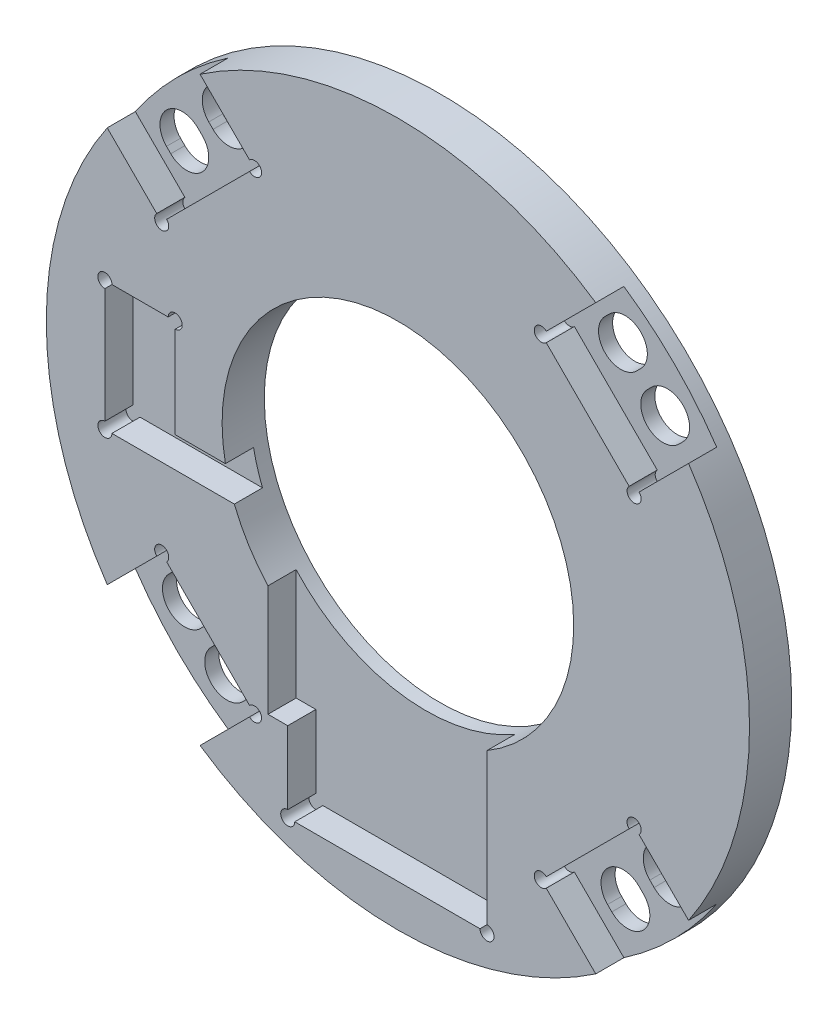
from build123d import *

# Parameters (mm, degrees)
SKETCH1_R           = 150
SKETCH1_R_2         = 75
BOSS_EXTRUDE1_DEPTH = 18
CUT_EXTRUDE1_START  = -12
CUT_EXTRUDE1_DEPTH  = 225.894339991
CUT_EXTRUDE2_DEPTH  = 213.471174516
CIRPATTERN1_COUNT   = 4
CIRPATTERN2_COUNT   = 4
SKETCH4_W           = 85
SKETCH4_H           = 83.042304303
CUT_EXTRUDE3_DEPTH  = 12
SKETCH5_W           = 30
SKETCH5_H           = 55
CUT_EXTRUDE4_DEPTH  = 12
SKETCH6_W           = 8.427968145
SKETCH6_H           = 47.462704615
SKETCH6_W_2         = 36.374462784
SKETCH6_H_2         = 13.018692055
CUT_EXTRUDE5_DEPTH  = 12
SKETCH7_R           = 3
CUT_EXTRUDE6_DEPTH  = 12


with BuildPart() as part:
    # Sketch1 → Boss-Extrude1 (new body)
    with BuildSketch(Plane.XY):
        Circle(SKETCH1_R)
        Circle(SKETCH1_R_2, mode=Mode.SUBTRACT)
    extrude(amount=BOSS_EXTRUDE1_DEPTH)

    # Sketch2 → Cut-Extrude1 (cut)
    with BuildSketch(Plane.XY.offset(18).offset(CUT_EXTRUDE1_START)):
        Polygon((-641.214257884, 601.616278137), (-124.067273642, 84.469293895), (-100.762716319, 61.164736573), (-61.164736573, 100.762716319), (-84.469293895, 124.067273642), (-601.616278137, 641.214257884), (-1635.910246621, 1675.508226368), (-1675.508226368, 1635.910246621), align=None)
    cut_extrude1 = extrude(amount=CUT_EXTRUDE1_DEPTH, mode=Mode.SUBTRACT)

    # Sketch3 → Cut-Extrude2 (cut, through all)
    with BuildSketch(Plane.XY.offset(6)):
        with BuildLine():
            Line((-110.72077849, 78.193866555), (-108.894444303, 76.367532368))
            ThreePointArc((-108.894444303, 76.367532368), (-95.45941546, 76.367532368), (-95.45941546, 89.802561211))
            Line((-95.45941546, 89.802561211), (-97.285749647, 91.628895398))
            ThreePointArc((-97.285749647, 91.628895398), (-110.72077849, 91.628895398), (-110.72077849, 78.193866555))
        make_face()
        with BuildLine():
            Line((-92.68955557, 96.225089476), (-90.863221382, 94.398755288))
            ThreePointArc((-90.863221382, 94.398755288), (-77.42819254, 94.398755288), (-77.42819254, 107.833784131))
            Line((-77.42819254, 107.833784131), (-79.254526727, 109.660118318))
            ThreePointArc((-79.254526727, 109.660118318), (-92.68955557, 109.660118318), (-92.68955557, 96.225089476))
        make_face()
    cut_extrude2 = extrude(amount=-CUT_EXTRUDE2_DEPTH, mode=Mode.SUBTRACT)

    # CirPattern1: Cut-Extrude1 ×4 about axis
    cirpattern1_axis = Axis((0, 0, 18), (0, 0, -1))
    for i in range(1, CIRPATTERN1_COUNT):
        add(cut_extrude1.rotate(cirpattern1_axis, i * 360 / CIRPATTERN1_COUNT), mode=Mode.SUBTRACT)

    # CirPattern2: Cut-Extrude2 ×4 about axis
    cirpattern2_axis = Axis((0, 0, 0), (0, 0, 1))
    for i in range(1, CIRPATTERN2_COUNT):
        add(cut_extrude2.rotate(cirpattern2_axis, i * 360 / CIRPATTERN2_COUNT), mode=Mode.SUBTRACT)

    # Sketch4 → Cut-Extrude3 (cut)
    with BuildSketch(Plane.XY.offset(18)):
        with Locations((-4.5, -90.478847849)):
            Rectangle(SKETCH4_W, SKETCH4_H)
    extrude(amount=-CUT_EXTRUDE3_DEPTH, mode=Mode.SUBTRACT)

    # Sketch5 → Cut-Extrude4 (cut)
    with BuildSketch(Plane.XY.offset(18)):
        with Locations((-110.004736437, 0)):
            Rectangle(SKETCH5_W, SKETCH5_H)
    extrude(amount=-CUT_EXTRUDE4_DEPTH, mode=Mode.SUBTRACT)

    # Sketch6 → Cut-Extrude5 (cut)
    with BuildSketch(Plane.XY.offset(18)):
        with Locations((-51.213984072, -74.256003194)):
            Rectangle(SKETCH6_W, SKETCH6_H)
        with Locations((-76.817505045, -20.990653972)):
            Rectangle(SKETCH6_W_2, SKETCH6_H_2)
    extrude(amount=-CUT_EXTRUDE5_DEPTH, mode=Mode.SUBTRACT)

    # Sketch7 → Cut-Extrude6 (cut)
    with BuildSketch(Plane.XY.offset(18)):
        with Locations((100.762716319, 61.164736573)):
            Circle(SKETCH7_R)
        with Locations((61.164736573, 100.762716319)):
            Circle(SKETCH7_R)
        with Locations((-61.164736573, 100.762716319)):
            Circle(SKETCH7_R)
        with Locations((-100.762716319, 61.164736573)):
            Circle(SKETCH7_R)
        with Locations((-125.004736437, 27.5)):
            Circle(SKETCH7_R)
        with Locations((-95.004736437, 27.5)):
            Circle(SKETCH7_R)
        with Locations((-125.004736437, -27.5)):
            Circle(SKETCH7_R)
        with Locations((-100.762716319, -61.164736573)):
            Circle(SKETCH7_R)
        with Locations((-61.164736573, -100.762716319)):
            Circle(SKETCH7_R)
        with Locations((-47, -132)):
            Circle(SKETCH7_R)
        with Locations((38, -132)):
            Circle(SKETCH7_R)
        with Locations((61.164736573, -100.762716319)):
            Circle(SKETCH7_R)
        with Locations((100.762716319, -61.164736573)):
            Circle(SKETCH7_R)
    extrude(amount=-CUT_EXTRUDE6_DEPTH, mode=Mode.SUBTRACT)


solid = part.part
